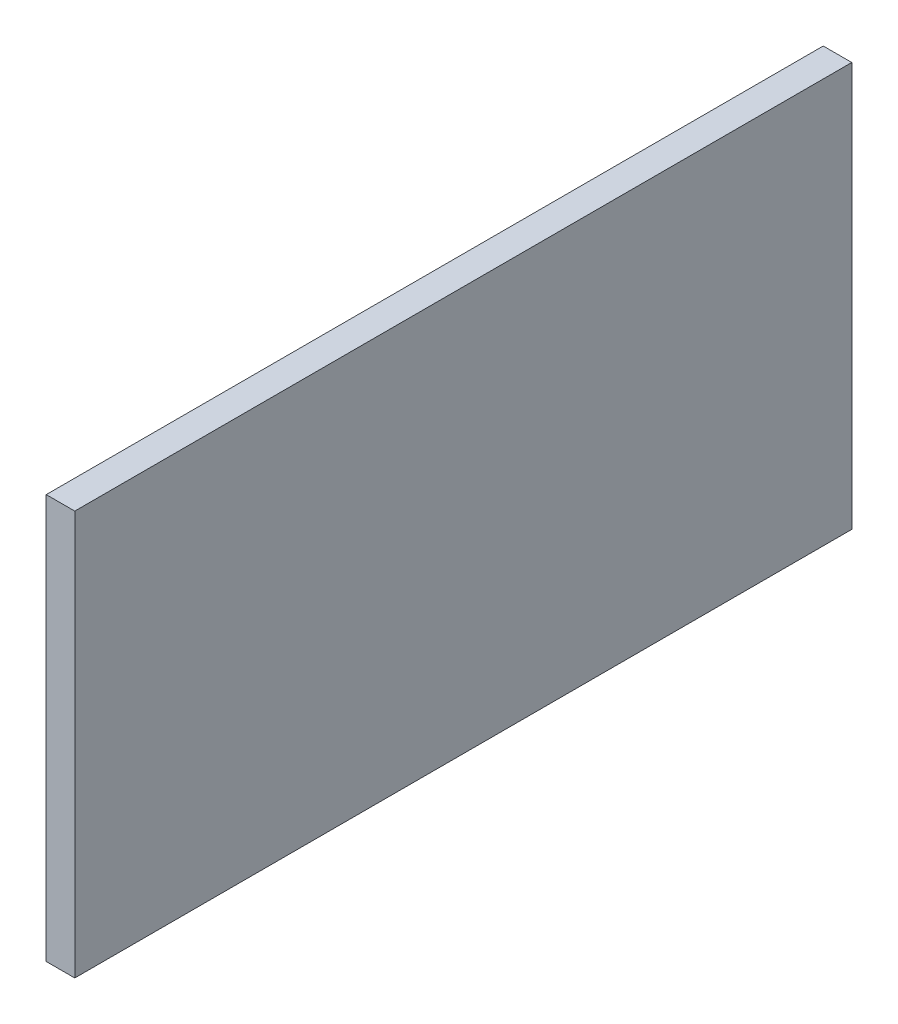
from build123d import *

# Parameters (mm, degrees)
ESBO_O2_W                = 18
ESBO_O2_H                = 255
RESSALTO_EXTRUS_O1_DEPTH = 490


with BuildPart() as part:
    # Esbo_o2 → Ressalto-extrus_o1 (new body)
    with BuildSketch(Plane.XY):
        with Locations((272, 805.031682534)):
            Rectangle(ESBO_O2_W, ESBO_O2_H)
    extrude(amount=-RESSALTO_EXTRUS_O1_DEPTH)


solid = part.part
